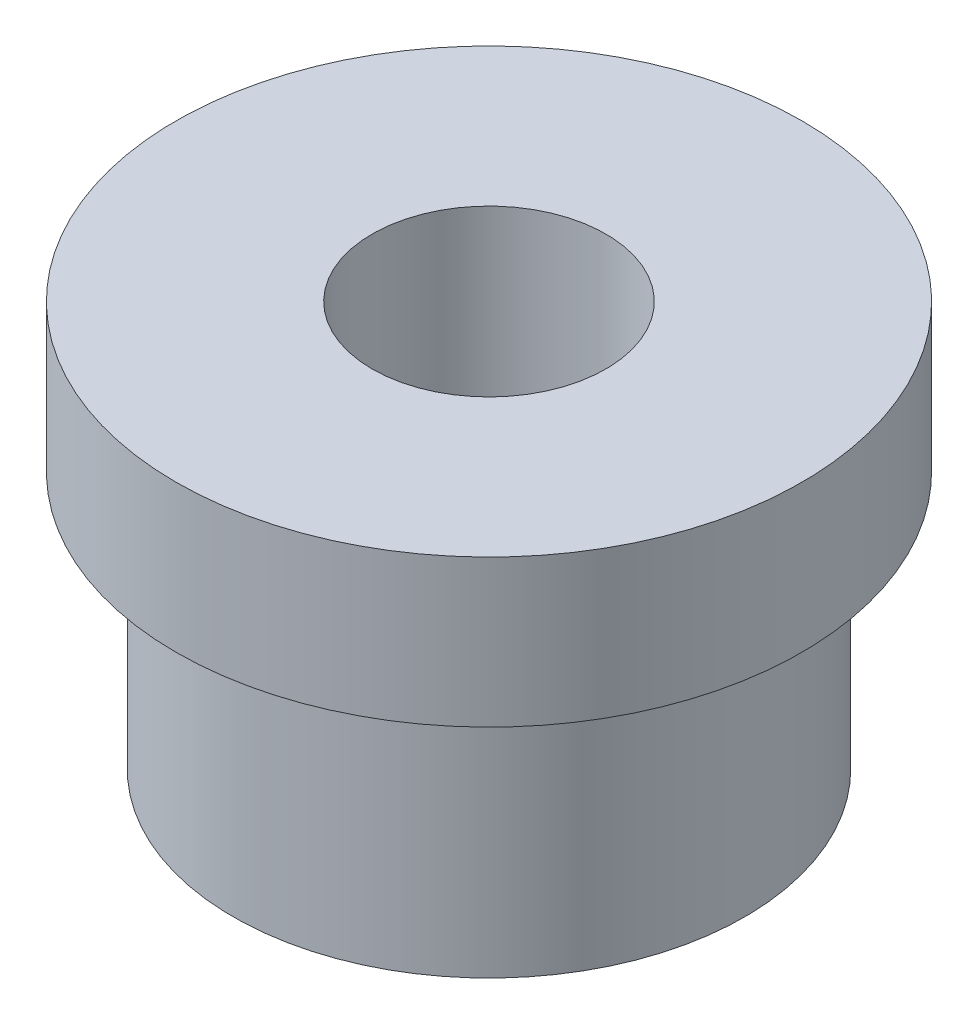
ISO-10303-21;
HEADER;
FILE_DESCRIPTION(('STEP AP214'),'2;1');
FILE_NAME('part.step','',(''),(''),'','','');
FILE_SCHEMA(('AUTOMOTIVE_DESIGN { 1 0 10303 214 1 1 1 1 }'));
ENDSEC;
DATA;
#1=APPLICATION_CONTEXT('core data for automotive mechanical design processes');
#2=APPLICATION_PROTOCOL_DEFINITION('international standard','automotive_design',2000,#1);
#3=PRODUCT_CONTEXT('',#1,'mechanical');
#4=PRODUCT('Part','Part','',(#3));
#5=PRODUCT_RELATED_PRODUCT_CATEGORY('part','',(#4));
#6=PRODUCT_DEFINITION_FORMATION('','',#4);
#7=PRODUCT_DEFINITION_CONTEXT('part definition',#1,'design');
#8=PRODUCT_DEFINITION('design','',#6,#7);
#9=PRODUCT_DEFINITION_SHAPE('','',#8);
#10=(LENGTH_UNIT() NAMED_UNIT(*) SI_UNIT(.MILLI.,.METRE.));
#11=(NAMED_UNIT(*) PLANE_ANGLE_UNIT() SI_UNIT($,.RADIAN.));
#12=(NAMED_UNIT(*) SI_UNIT($,.STERADIAN.) SOLID_ANGLE_UNIT());
#13=UNCERTAINTY_MEASURE_WITH_UNIT(LENGTH_MEASURE(1.E-05),#10,'distance_accuracy_value','');
#14=(GEOMETRIC_REPRESENTATION_CONTEXT(3) GLOBAL_UNCERTAINTY_ASSIGNED_CONTEXT((#13)) GLOBAL_UNIT_ASSIGNED_CONTEXT((#10,
#11,#12)) REPRESENTATION_CONTEXT('',''));
#15=CARTESIAN_POINT('',(0.,0.,0.));
#16=DIRECTION('',(0.,0.,1.));
#17=DIRECTION('',(1.,0.,0.));
#18=AXIS2_PLACEMENT_3D('',#15,#16,#17);
#19=CARTESIAN_POINT('',(0.,-50.,0.));
#20=DIRECTION('',(0.,-1.,0.));
#21=DIRECTION('',(0.,0.,-1.));
#22=AXIS2_PLACEMENT_3D('',#19,#20,#21);
#23=CYLINDRICAL_SURFACE('',#22,4.25);
#24=CARTESIAN_POINT('',(0.,0.750000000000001,0.));
#25=DIRECTION('',(0.,-1.,0.));
#26=DIRECTION('',(0.,0.,-1.));
#27=AXIS2_PLACEMENT_3D('',#24,#25,#26);
#28=CIRCLE('',#27,4.25);
#29=CARTESIAN_POINT('',(0.,0.750000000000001,-4.25));
#30=VERTEX_POINT('',#29);
#31=EDGE_CURVE('E10',#30,#30,#28,.T.);
#32=ORIENTED_EDGE('',*,*,#31,.F.);
#33=EDGE_LOOP('',(#32));
#34=FACE_BOUND('',#33,.T.);
#35=CARTESIAN_POINT('',(0.,2.75,0.));
#36=DIRECTION('',(0.,-1.,0.));
#37=DIRECTION('',(0.,0.,-1.));
#38=AXIS2_PLACEMENT_3D('',#35,#36,#37);
#39=CIRCLE('',#38,4.25);
#40=CARTESIAN_POINT('',(0.,2.75,-4.25));
#41=VERTEX_POINT('',#40);
#42=EDGE_CURVE('E44',#41,#41,#39,.T.);
#43=ORIENTED_EDGE('',*,*,#42,.T.);
#44=EDGE_LOOP('',(#43));
#45=FACE_BOUND('',#44,.T.);
#46=ADVANCED_FACE('F30',(#34,#45),#23,.T.);
#47=CARTESIAN_POINT('',(0.,0.75,4.25));
#48=DIRECTION('',(0.,1.,0.));
#49=DIRECTION('',(0.,0.,1.));
#50=AXIS2_PLACEMENT_3D('',#47,#48,#49);
#51=PLANE('',#50);
#52=CARTESIAN_POINT('',(0.,0.750000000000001,0.));
#53=DIRECTION('',(0.,-1.,0.));
#54=DIRECTION('',(0.,0.,-1.));
#55=AXIS2_PLACEMENT_3D('',#52,#53,#54);
#56=CIRCLE('',#55,3.47345);
#57=CARTESIAN_POINT('',(0.,0.750000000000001,-3.47345));
#58=VERTEX_POINT('',#57);
#59=EDGE_CURVE('E36',#58,#58,#56,.T.);
#60=ORIENTED_EDGE('',*,*,#59,.F.);
#61=EDGE_LOOP('',(#60));
#62=FACE_BOUND('',#61,.T.);
#63=ORIENTED_EDGE('',*,*,#31,.T.);
#64=EDGE_LOOP('',(#63));
#65=FACE_BOUND('',#64,.T.);
#66=ADVANCED_FACE('F66',(#62,#65),#51,.F.);
#67=CARTESIAN_POINT('',(0.,-50.,0.));
#68=DIRECTION('',(0.,-1.,0.));
#69=DIRECTION('',(0.,0.,-1.));
#70=AXIS2_PLACEMENT_3D('',#67,#68,#69);
#71=CYLINDRICAL_SURFACE('',#70,3.47345);
#72=CARTESIAN_POINT('',(0.,-2.75,0.));
#73=DIRECTION('',(0.,-1.,0.));
#74=DIRECTION('',(0.,0.,-1.));
#75=AXIS2_PLACEMENT_3D('',#72,#73,#74);
#76=CIRCLE('',#75,3.47345);
#77=CARTESIAN_POINT('',(0.,-2.75,-3.47345));
#78=VERTEX_POINT('',#77);
#79=EDGE_CURVE('E40',#78,#78,#76,.T.);
#80=ORIENTED_EDGE('',*,*,#79,.F.);
#81=EDGE_LOOP('',(#80));
#82=FACE_BOUND('',#81,.T.);
#83=ORIENTED_EDGE('',*,*,#59,.T.);
#84=EDGE_LOOP('',(#83));
#85=FACE_BOUND('',#84,.T.);
#86=ADVANCED_FACE('F71',(#82,#85),#71,.T.);
#87=CARTESIAN_POINT('',(0.,-2.75,3.47345));
#88=DIRECTION('',(0.,1.,0.));
#89=DIRECTION('',(0.,0.,1.));
#90=AXIS2_PLACEMENT_3D('',#87,#88,#89);
#91=PLANE('',#90);
#92=CARTESIAN_POINT('',(0.,-2.75,0.));
#93=DIRECTION('',(0.,1.,0.));
#94=DIRECTION('',(0.,0.,1.));
#95=AXIS2_PLACEMENT_3D('',#92,#93,#94);
#96=CIRCLE('',#95,1.5875);
#97=CARTESIAN_POINT('',(0.,-2.75,1.5875));
#98=VERTEX_POINT('',#97);
#99=EDGE_CURVE('E49',#98,#98,#96,.T.);
#100=ORIENTED_EDGE('',*,*,#99,.T.);
#101=EDGE_LOOP('',(#100));
#102=FACE_BOUND('',#101,.T.);
#103=ORIENTED_EDGE('',*,*,#79,.T.);
#104=EDGE_LOOP('',(#103));
#105=FACE_BOUND('',#104,.T.);
#106=ADVANCED_FACE('F61',(#102,#105),#91,.F.);
#107=CARTESIAN_POINT('',(0.,2.75,0.));
#108=DIRECTION('',(0.,-1.,0.));
#109=DIRECTION('',(0.,0.,-1.));
#110=AXIS2_PLACEMENT_3D('',#107,#108,#109);
#111=PLANE('',#110);
#112=CARTESIAN_POINT('',(0.,2.75,0.));
#113=DIRECTION('',(0.,1.,0.));
#114=DIRECTION('',(0.,0.,1.));
#115=AXIS2_PLACEMENT_3D('',#112,#113,#114);
#116=CIRCLE('',#115,1.58749999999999);
#117=CARTESIAN_POINT('',(0.,2.75,1.58749999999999));
#118=VERTEX_POINT('',#117);
#119=EDGE_CURVE('E52',#118,#118,#116,.T.);
#120=ORIENTED_EDGE('',*,*,#119,.F.);
#121=EDGE_LOOP('',(#120));
#122=FACE_BOUND('',#121,.T.);
#123=ORIENTED_EDGE('',*,*,#42,.F.);
#124=EDGE_LOOP('',(#123));
#125=FACE_BOUND('',#124,.T.);
#126=ADVANCED_FACE('F58',(#122,#125),#111,.F.);
#127=CARTESIAN_POINT('',(0.,2.75,0.));
#128=DIRECTION('',(0.,1.,0.));
#129=DIRECTION('',(0.,0.,1.));
#130=AXIS2_PLACEMENT_3D('',#127,#128,#129);
#131=CYLINDRICAL_SURFACE('',#130,1.58749999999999);
#132=ORIENTED_EDGE('',*,*,#99,.F.);
#133=EDGE_LOOP('',(#132));
#134=FACE_BOUND('',#133,.T.);
#135=ORIENTED_EDGE('',*,*,#119,.T.);
#136=EDGE_LOOP('',(#135));
#137=FACE_BOUND('',#136,.T.);
#138=ADVANCED_FACE('F56',(#134,#137),#131,.F.);
#139=CLOSED_SHELL('',(#46,#66,#86,#106,#126,#138));
#140=MANIFOLD_SOLID_BREP('B2',#139);
#141=ADVANCED_BREP_SHAPE_REPRESENTATION('',(#18,#140),#14);
#142=SHAPE_DEFINITION_REPRESENTATION(#9,#141);
ENDSEC;
END-ISO-10303-21;
